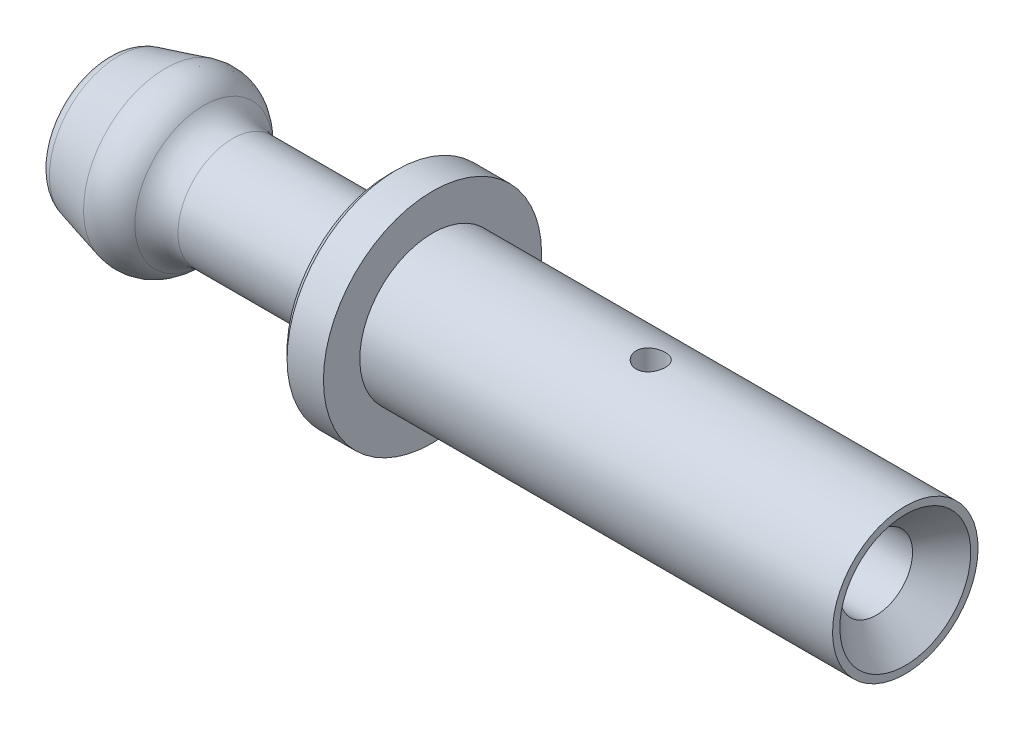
from build123d import *

# Parameters (mm, degrees)
SKETCH2_R          = 0.4
CUT_EXTRUDE1_DEPTH = 23.405356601


with BuildPart() as part:
    # Sketch1 → Revolve1 (revolve)
    with BuildSketch(Plane.XY):
        with BuildLine():
            Line((0, 1.8), (-0.8, 1))
            Line((-0.8, 1), (-7.711324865, 1))
            Line((-7.711324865, 1), (-8, 0.5))
            Line((-8, 0.5), (-21.5, 0.5))
            Line((-21.5, 0.5), (-22, 1))
            Line((-22, 1), (-22, 1.423349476))
            ThreePointArc((-22, 1.423349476), (-21.89667667, 1.72773019), (-21.629409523, 1.906312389))
            Line((-21.629409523, 1.906312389), (-20.346749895, 2.25))
            ThreePointArc((-20.346749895, 2.25), (-19.766015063, 2.23084248), (-19.293965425, 1.892037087))
            ThreePointArc((-19.293965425, 1.892037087), (-18.942739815, 1.603349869), (-18.5, 1.5))
            Line((-18.5, 1.5), (-15, 1.5))
            ThreePointArc((-15, 1.5), (-14.434314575, 1.734314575), (-14.2, 2.3))
            Line((-14.2, 2.3), (-14.2, 2.8))
            Line((-14.2, 2.8), (-14, 3))
            Line((-14, 3), (-13, 3))
            Line((-13, 3), (-13, 2))
            Line((-13, 2), (0, 2))
            Line((0, 2), (0, 1.8))
        make_face()
    revolve(axis=Axis((0, 0, 0), (-1, 0, 0)))

    # Sketch2 → Cut-Extrude1 (cut, through all)
    with BuildSketch(Plane(origin=(0, 0, 0), x_dir=(1, 0, 0), z_dir=(0, 1, 0))):
        with Locations(Location((-7, 0, 0), (0, 0, 180))):
            Circle(SKETCH2_R)
    extrude(amount=CUT_EXTRUDE1_DEPTH, mode=Mode.SUBTRACT)


solid = part.part
